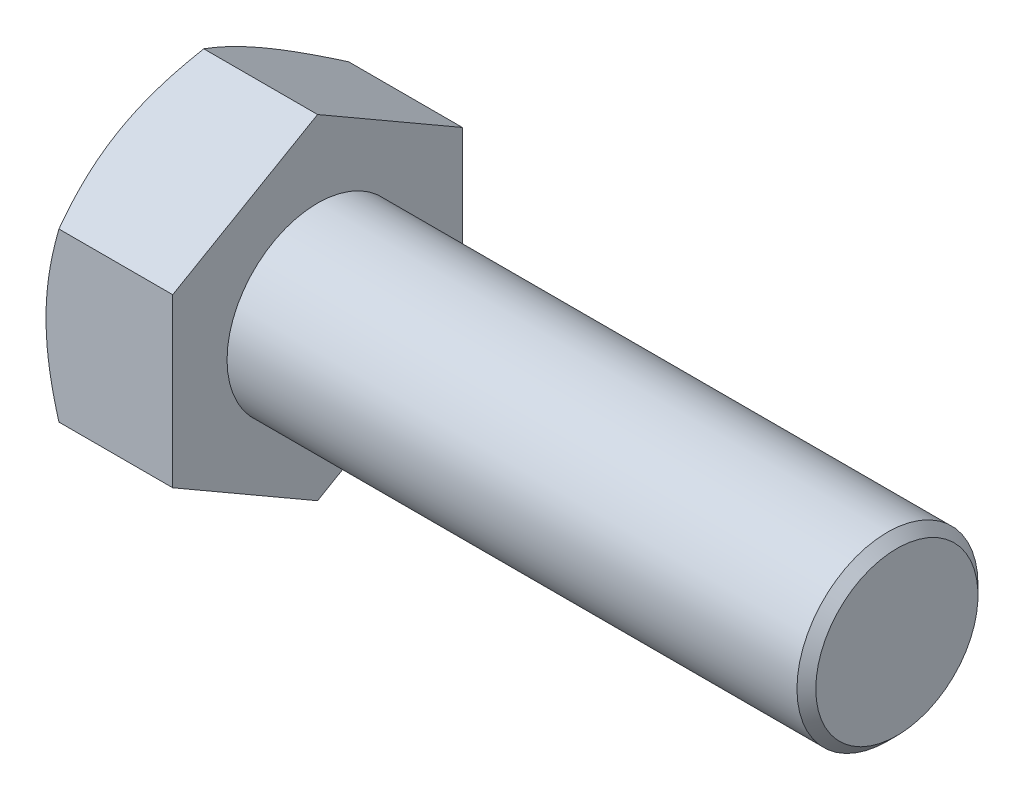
ISO-10303-21;
HEADER;
FILE_DESCRIPTION(('STEP AP214'),'2;1');
FILE_NAME('part.step','',(''),(''),'','','');
FILE_SCHEMA(('AUTOMOTIVE_DESIGN { 1 0 10303 214 1 1 1 1 }'));
ENDSEC;
DATA;
#1=APPLICATION_CONTEXT('core data for automotive mechanical design processes');
#2=APPLICATION_PROTOCOL_DEFINITION('international standard','automotive_design',2000,#1);
#3=PRODUCT_CONTEXT('',#1,'mechanical');
#4=PRODUCT('Part','Part','',(#3));
#5=PRODUCT_RELATED_PRODUCT_CATEGORY('part','',(#4));
#6=PRODUCT_DEFINITION_FORMATION('','',#4);
#7=PRODUCT_DEFINITION_CONTEXT('part definition',#1,'design');
#8=PRODUCT_DEFINITION('design','',#6,#7);
#9=PRODUCT_DEFINITION_SHAPE('','',#8);
#10=(LENGTH_UNIT() NAMED_UNIT(*) SI_UNIT(.MILLI.,.METRE.));
#11=(NAMED_UNIT(*) PLANE_ANGLE_UNIT() SI_UNIT($,.RADIAN.));
#12=(NAMED_UNIT(*) SI_UNIT($,.STERADIAN.) SOLID_ANGLE_UNIT());
#13=UNCERTAINTY_MEASURE_WITH_UNIT(LENGTH_MEASURE(1.E-05),#10,'distance_accuracy_value','');
#14=(GEOMETRIC_REPRESENTATION_CONTEXT(3) GLOBAL_UNCERTAINTY_ASSIGNED_CONTEXT((#13)) GLOBAL_UNIT_ASSIGNED_CONTEXT((#10,
#11,#12)) REPRESENTATION_CONTEXT('',''));
#15=CARTESIAN_POINT('',(0.,0.,0.));
#16=DIRECTION('',(0.,0.,1.));
#17=DIRECTION('',(1.,0.,0.));
#18=AXIS2_PLACEMENT_3D('',#15,#16,#17);
#19=CARTESIAN_POINT('',(0.,4.61880215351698,0.));
#20=DIRECTION('',(1.,0.,0.));
#21=DIRECTION('',(0.,0.,-1.));
#22=AXIS2_PLACEMENT_3D('',#19,#20,#21);
#23=PLANE('',#22);
#24=CARTESIAN_POINT('',(0.,0.,0.));
#25=DIRECTION('',(1.,0.,0.));
#26=DIRECTION('',(0.,0.,-1.));
#27=AXIS2_PLACEMENT_3D('',#24,#25,#26);
#28=CIRCLE('',#27,4.0000000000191);
#29=CARTESIAN_POINT('',(-5.52335954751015E-12,-3.46410161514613,-2.00000000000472));
#30=VERTEX_POINT('',#29);
#31=CARTESIAN_POINT('',(-5.52335954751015E-12,0.,-4.0000000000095));
#32=VERTEX_POINT('',#31);
#33=EDGE_CURVE('E347',#30,#32,#28,.T.);
#34=ORIENTED_EDGE('',*,*,#33,.F.);
#35=CARTESIAN_POINT('',(0.,0.,0.));
#36=DIRECTION('',(1.,0.,0.));
#37=DIRECTION('',(0.,0.,-1.));
#38=AXIS2_PLACEMENT_3D('',#35,#36,#37);
#39=CIRCLE('',#38,4.0000000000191);
#40=CARTESIAN_POINT('',(-5.49560397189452E-12,-3.46410161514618,2.00000000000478));
#41=VERTEX_POINT('',#40);
#42=EDGE_CURVE('E346',#41,#30,#39,.T.);
#43=ORIENTED_EDGE('',*,*,#42,.F.);
#44=CARTESIAN_POINT('',(0.,0.,0.));
#45=DIRECTION('',(1.,0.,0.));
#46=DIRECTION('',(0.,0.,-1.));
#47=AXIS2_PLACEMENT_3D('',#44,#45,#46);
#48=CIRCLE('',#47,4.0000000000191);
#49=CARTESIAN_POINT('',(-5.49560397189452E-12,0.,4.00000000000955));
#50=VERTEX_POINT('',#49);
#51=EDGE_CURVE('E96',#50,#41,#48,.T.);
#52=ORIENTED_EDGE('',*,*,#51,.F.);
#53=CARTESIAN_POINT('',(0.,0.,0.));
#54=DIRECTION('',(1.,0.,0.));
#55=DIRECTION('',(0.,0.,-1.));
#56=AXIS2_PLACEMENT_3D('',#53,#54,#55);
#57=CIRCLE('',#56,4.0000000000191);
#58=CARTESIAN_POINT('',(-5.49560397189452E-12,3.4641016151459,2.00000000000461));
#59=VERTEX_POINT('',#58);
#60=EDGE_CURVE('E94',#59,#50,#57,.T.);
#61=ORIENTED_EDGE('',*,*,#60,.F.);
#62=CARTESIAN_POINT('',(0.,0.,0.));
#63=DIRECTION('',(1.,0.,0.));
#64=DIRECTION('',(0.,0.,-1.));
#65=AXIS2_PLACEMENT_3D('',#62,#63,#64);
#66=CIRCLE('',#65,4.0000000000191);
#67=CARTESIAN_POINT('',(-5.49560397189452E-12,3.46410161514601,-2.00000000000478));
#68=VERTEX_POINT('',#67);
#69=EDGE_CURVE('E27',#68,#59,#66,.T.);
#70=ORIENTED_EDGE('',*,*,#69,.F.);
#71=CARTESIAN_POINT('',(0.,0.,0.));
#72=DIRECTION('',(1.,0.,0.));
#73=DIRECTION('',(0.,0.,-1.));
#74=AXIS2_PLACEMENT_3D('',#71,#72,#73);
#75=CIRCLE('',#74,4.0000000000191);
#76=EDGE_CURVE('E272',#32,#68,#75,.T.);
#77=ORIENTED_EDGE('',*,*,#76,.F.);
#78=EDGE_LOOP('',(#34,#43,#52,#61,#70,#77));
#79=FACE_BOUND('',#78,.T.);
#80=ADVANCED_FACE('F24',(#79),#23,.F.);
#81=CARTESIAN_POINT('',(0.359409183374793,0.,0.));
#82=DIRECTION('',(1.,0.,0.));
#83=DIRECTION('',(0.,0.,-1.));
#84=AXIS2_PLACEMENT_3D('',#81,#82,#83);
#85=CONICAL_SURFACE('',#84,4.62251496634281,1.04719755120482);
#86=CARTESIAN_POINT('',(0.357265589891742,4.61880215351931,4.10782519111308E-12));
#87=CARTESIAN_POINT('',(0.302985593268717,4.52481002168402,-0.162799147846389));
#88=CARTESIAN_POINT('',(0.253255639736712,4.43006516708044,-0.326902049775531));
#89=CARTESIAN_POINT('',(0.165557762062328,4.23974029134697,-0.656554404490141));
#90=CARTESIAN_POINT('',(0.127531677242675,4.14416690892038,-0.822092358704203));
#91=CARTESIAN_POINT('',(0.0808421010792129,3.99990485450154,-1.0719615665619));
#92=CARTESIAN_POINT('',(0.0669981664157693,3.95163526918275,-1.15556694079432));
#93=CARTESIAN_POINT('',(0.0430340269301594,3.85486501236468,-1.3231779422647));
#94=CARTESIAN_POINT('',(0.032913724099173,3.80636434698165,-1.40718355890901));
#95=CARTESIAN_POINT('',(0.0165746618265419,3.70895253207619,-1.57590577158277));
#96=CARTESIAN_POINT('',(0.0103757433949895,3.66004054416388,-1.66062381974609));
#97=CARTESIAN_POINT('',(0.00207983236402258,3.5621203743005,-1.83022652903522));
#98=CARTESIAN_POINT('',(-1.63478619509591E-05,3.51311217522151,-1.91511121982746));
#99=CARTESIAN_POINT('',(-1.10189635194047E-11,3.46410161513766,-2.00000000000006));
#100=B_SPLINE_CURVE_WITH_KNOTS('',3,(#86,#87,#88,#89,#90,#91,#92,#93,#94,#95,#96,#97,#98,#99),
.UNSPECIFIED.,.F.,.F.,(4,2,2,2,2,2,4),(0.,0.587229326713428,1.17149154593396,1.46400599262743,
1.75651273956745,2.05048788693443,2.34452123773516),.UNSPECIFIED.);
#101=CARTESIAN_POINT('',(0.357265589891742,4.61880215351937,0.));
#102=VERTEX_POINT('',#101);
#103=EDGE_CURVE('E106',#102,#68,#100,.T.);
#104=ORIENTED_EDGE('',*,*,#103,.T.);
#105=ORIENTED_EDGE('',*,*,#69,.T.);
#106=CARTESIAN_POINT('',(-1.10189635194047E-11,3.46410161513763,1.99999999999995));
#107=CARTESIAN_POINT('',(-1.63478619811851E-05,3.51311217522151,1.91511121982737));
#108=CARTESIAN_POINT('',(0.00207983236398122,3.56212037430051,1.83022652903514));
#109=CARTESIAN_POINT('',(0.0103757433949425,3.66004054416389,1.66062381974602));
#110=CARTESIAN_POINT('',(0.0165746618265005,3.70895253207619,1.5759057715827));
#111=CARTESIAN_POINT('',(0.0329137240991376,3.80636434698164,1.40718355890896));
#112=CARTESIAN_POINT('',(0.0430340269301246,3.85486501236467,1.32317794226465));
#113=CARTESIAN_POINT('',(0.0669981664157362,3.95163526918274,1.15556694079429));
#114=CARTESIAN_POINT('',(0.0808421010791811,3.99990485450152,1.07196156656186));
#115=CARTESIAN_POINT('',(0.127531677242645,4.14416690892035,0.822092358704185));
#116=CARTESIAN_POINT('',(0.165557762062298,4.23974029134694,0.656554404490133));
#117=CARTESIAN_POINT('',(0.253255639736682,4.4300651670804,0.326902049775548));
#118=CARTESIAN_POINT('',(0.302985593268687,4.52481002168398,0.162799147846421));
#119=CARTESIAN_POINT('',(0.357265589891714,4.61880215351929,-4.05231403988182E-12));
#120=B_SPLINE_CURVE_WITH_KNOTS('',3,(#106,#107,#108,#109,#110,#111,#112,#113,#114,#115,#116,
#117,#118,#119),.UNSPECIFIED.,.F.,.F.,(4,2,2,2,2,2,4),(0.,0.294033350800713,0.588008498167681,
0.880515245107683,1.17302969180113,1.75729191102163,2.34452123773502),.UNSPECIFIED.);
#121=EDGE_CURVE('E104',#59,#102,#120,.T.);
#122=ORIENTED_EDGE('',*,*,#121,.T.);
#123=EDGE_LOOP('',(#104,#105,#122));
#124=FACE_BOUND('',#123,.T.);
#125=ADVANCED_FACE('F102',(#124),#85,.T.);
#126=CARTESIAN_POINT('',(0.359409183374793,0.,0.));
#127=DIRECTION('',(1.,0.,0.));
#128=DIRECTION('',(0.,0.,-1.));
#129=AXIS2_PLACEMENT_3D('',#126,#127,#128);
#130=CONICAL_SURFACE('',#129,4.62251496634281,1.04719755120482);
#131=CARTESIAN_POINT('',(0.357265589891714,2.30940107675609,4.00000000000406));
#132=CARTESIAN_POINT('',(0.302985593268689,2.40339320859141,3.83720085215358));
#133=CARTESIAN_POINT('',(0.253255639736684,2.49813806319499,3.67309795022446));
#134=CARTESIAN_POINT('',(0.165557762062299,2.68846293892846,3.34344559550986));
#135=CARTESIAN_POINT('',(0.127531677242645,2.78403632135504,3.17790764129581));
#136=CARTESIAN_POINT('',(0.0808421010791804,2.92829837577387,2.92803843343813));
#137=CARTESIAN_POINT('',(0.0669981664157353,2.97656796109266,2.8444330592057));
#138=CARTESIAN_POINT('',(0.0430340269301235,3.07333821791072,2.67682205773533));
#139=CARTESIAN_POINT('',(0.0329137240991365,3.12183888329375,2.59281644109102));
#140=CARTESIAN_POINT('',(0.0165746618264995,3.21925069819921,2.42409422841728));
#141=CARTESIAN_POINT('',(0.0103757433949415,3.26816268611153,2.33937618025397));
#142=CARTESIAN_POINT('',(0.00207983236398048,3.36608285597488,2.16977347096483));
#143=CARTESIAN_POINT('',(-1.6347861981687E-05,3.41509105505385,2.08488878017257));
#144=CARTESIAN_POINT('',(-1.10189635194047E-11,3.46410161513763,1.99999999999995));
#145=B_SPLINE_CURVE_WITH_KNOTS('',3,(#131,#132,#133,#134,#135,#136,#137,#138,#139,#140,#141,
#142,#143,#144),.UNSPECIFIED.,.F.,.F.,(4,2,2,2,2,2,4),(0.,0.587229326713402,1.17149154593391,
1.46400599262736,1.75651273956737,2.05048788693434,2.34452123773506),.UNSPECIFIED.);
#146=CARTESIAN_POINT('',(0.357265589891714,2.30940107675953,4.000000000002));
#147=VERTEX_POINT('',#146);
#148=EDGE_CURVE('E109',#147,#59,#145,.T.);
#149=ORIENTED_EDGE('',*,*,#148,.T.);
#150=ORIENTED_EDGE('',*,*,#60,.T.);
#151=CARTESIAN_POINT('',(-1.10189635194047E-11,0.,3.99999999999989));
#152=CARTESIAN_POINT('',(-1.63478619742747E-05,0.0980211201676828,3.99999999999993));
#153=CARTESIAN_POINT('',(0.00207983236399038,0.196037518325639,3.99999999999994));
#154=CARTESIAN_POINT('',(0.010375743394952,0.391877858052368,3.99999999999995));
#155=CARTESIAN_POINT('',(0.016574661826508,0.489701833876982,3.99999999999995));
#156=CARTESIAN_POINT('',(0.0329137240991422,0.684525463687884,3.99999999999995));
#157=CARTESIAN_POINT('',(0.0430340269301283,0.781526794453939,3.99999999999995));
#158=CARTESIAN_POINT('',(0.0669981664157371,0.975067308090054,3.99999999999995));
#159=CARTESIAN_POINT('',(0.0808421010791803,1.07160647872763,3.99999999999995));
#160=CARTESIAN_POINT('',(0.127531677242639,1.36013058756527,3.99999999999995));
#161=CARTESIAN_POINT('',(0.165557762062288,1.55127735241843,3.99999999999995));
#162=CARTESIAN_POINT('',(0.253255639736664,1.93192710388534,3.99999999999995));
#163=CARTESIAN_POINT('',(0.302985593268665,2.1214168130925,3.99999999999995));
#164=CARTESIAN_POINT('',(0.357265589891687,2.30940107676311,3.99999999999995));
#165=B_SPLINE_CURVE_WITH_KNOTS('',3,(#151,#152,#153,#154,#155,#156,#157,#158,#159,#160,#161,
#162,#163,#164),.UNSPECIFIED.,.F.,.F.,(4,2,2,2,2,2,4),(0.,0.294033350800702,0.588008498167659,
0.880515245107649,1.17302969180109,1.75729191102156,2.34452123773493),.UNSPECIFIED.);
#166=EDGE_CURVE('E112',#50,#147,#165,.T.);
#167=ORIENTED_EDGE('',*,*,#166,.T.);
#168=EDGE_LOOP('',(#149,#150,#167));
#169=FACE_BOUND('',#168,.T.);
#170=ADVANCED_FACE('F110',(#169),#130,.T.);
#171=CARTESIAN_POINT('',(0.359409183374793,0.,0.));
#172=DIRECTION('',(1.,0.,0.));
#173=DIRECTION('',(0.,0.,-1.));
#174=AXIS2_PLACEMENT_3D('',#171,#172,#173);
#175=CONICAL_SURFACE('',#174,4.62251496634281,1.04719755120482);
#176=ORIENTED_EDGE('',*,*,#51,.T.);
#177=CARTESIAN_POINT('',(-1.10189635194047E-11,-3.46410161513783,1.99999999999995));
#178=CARTESIAN_POINT('',(-1.63478618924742E-05,-3.41509105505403,2.08488878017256));
#179=CARTESIAN_POINT('',(0.00207983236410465,-3.36608285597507,2.16977347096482));
#180=CARTESIAN_POINT('',(0.0103757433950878,-3.26816268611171,2.33937618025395));
#181=CARTESIAN_POINT('',(0.016574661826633,-3.2192506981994,2.42409422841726));
#182=CARTESIAN_POINT('',(0.0329137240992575,-3.12183888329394,2.59281644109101));
#183=CARTESIAN_POINT('',(0.0430340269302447,-3.07333821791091,2.67682205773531));
#184=CARTESIAN_POINT('',(0.0669981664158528,-2.97656796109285,2.84443305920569));
#185=CARTESIAN_POINT('',(0.080842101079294,-2.92829837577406,2.92803843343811));
#186=CARTESIAN_POINT('',(0.127531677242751,-2.78403632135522,3.17790764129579));
#187=CARTESIAN_POINT('',(0.165557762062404,-2.68846293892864,3.34344559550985));
#188=CARTESIAN_POINT('',(0.253255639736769,-2.49813806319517,3.67309795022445));
#189=CARTESIAN_POINT('',(0.302985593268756,-2.40339320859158,3.83720085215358));
#190=CARTESIAN_POINT('',(0.357265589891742,-2.30940107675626,4.00000000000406));
#191=B_SPLINE_CURVE_WITH_KNOTS('',3,(#177,#178,#179,#180,#181,#182,#183,#184,#185,#186,#187,
#188,#189,#190),.UNSPECIFIED.,.F.,.F.,(4,2,2,2,2,2,4),(0.,0.294033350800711,0.588008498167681,
0.880515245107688,1.17302969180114,1.75729191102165,2.34452123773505),.UNSPECIFIED.);
#192=CARTESIAN_POINT('',(0.357265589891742,-2.30940107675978,4.00000000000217));
#193=VERTEX_POINT('',#192);
#194=EDGE_CURVE('E187',#41,#193,#191,.T.);
#195=ORIENTED_EDGE('',*,*,#194,.T.);
#196=CARTESIAN_POINT('',(0.357265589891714,-2.30940107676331,4.));
#197=CARTESIAN_POINT('',(0.302985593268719,-2.12141681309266,3.99999999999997));
#198=CARTESIAN_POINT('',(0.253255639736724,-1.93192710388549,3.99999999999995));
#199=CARTESIAN_POINT('',(0.165557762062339,-1.55127735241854,3.99999999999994));
#200=CARTESIAN_POINT('',(0.127531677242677,-1.36013058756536,3.99999999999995));
#201=CARTESIAN_POINT('',(0.0808421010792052,-1.07160647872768,3.99999999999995));
#202=CARTESIAN_POINT('',(0.0669981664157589,-0.975067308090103,3.99999999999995));
#203=CARTESIAN_POINT('',(0.0430340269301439,-0.781526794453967,3.99999999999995));
#204=CARTESIAN_POINT('',(0.032913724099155,-0.684525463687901,3.99999999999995));
#205=CARTESIAN_POINT('',(0.0165746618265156,-0.489701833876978,3.99999999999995));
#206=CARTESIAN_POINT('',(0.0103757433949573,-0.391877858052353,3.99999999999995));
#207=CARTESIAN_POINT('',(0.00207983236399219,-0.196037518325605,3.99999999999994));
#208=CARTESIAN_POINT('',(-1.63478619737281E-05,-0.0980211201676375,3.99999999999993));
#209=CARTESIAN_POINT('',(-1.10189635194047E-11,0.,3.99999999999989));
#210=B_SPLINE_CURVE_WITH_KNOTS('',3,(#196,#197,#198,#199,#200,#201,#202,#203,#204,#205,#206,
#207,#208,#209),.UNSPECIFIED.,.F.,.F.,(4,2,2,2,2,2,4),(0.,0.58722932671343,1.17149154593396,
1.46400599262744,1.75651273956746,2.05048788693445,2.34452123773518),.UNSPECIFIED.);
#211=EDGE_CURVE('E159',#193,#50,#210,.T.);
#212=ORIENTED_EDGE('',*,*,#211,.T.);
#213=EDGE_LOOP('',(#176,#195,#212));
#214=FACE_BOUND('',#213,.T.);
#215=ADVANCED_FACE('F149',(#214),#175,.T.);
#216=CARTESIAN_POINT('',(0.359409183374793,0.,0.));
#217=DIRECTION('',(1.,0.,0.));
#218=DIRECTION('',(0.,0.,-1.));
#219=AXIS2_PLACEMENT_3D('',#216,#217,#218);
#220=CONICAL_SURFACE('',#219,4.62251496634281,1.04719755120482);
#221=ORIENTED_EDGE('',*,*,#42,.T.);
#222=CARTESIAN_POINT('',(-1.10189635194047E-11,-3.46410161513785,-2.));
#223=CARTESIAN_POINT('',(-1.63478618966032E-05,-3.51311217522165,-1.91511121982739));
#224=CARTESIAN_POINT('',(0.00207983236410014,-3.56212037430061,-1.83022652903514));
#225=CARTESIAN_POINT('',(0.0103757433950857,-3.66004054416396,-1.66062381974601));
#226=CARTESIAN_POINT('',(0.0165746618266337,-3.70895253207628,-1.5759057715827));
#227=CARTESIAN_POINT('',(0.0329137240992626,-3.80636434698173,-1.40718355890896));
#228=CARTESIAN_POINT('',(0.0430340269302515,-3.85486501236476,-1.32317794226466));
#229=CARTESIAN_POINT('',(0.0669981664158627,-3.95163526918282,-1.15556694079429));
#230=CARTESIAN_POINT('',(0.0808421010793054,-3.99990485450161,-1.07196156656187));
#231=CARTESIAN_POINT('',(0.127531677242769,-4.14416690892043,-0.822092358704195));
#232=CARTESIAN_POINT('',(0.165557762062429,-4.23974029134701,-0.656554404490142));
#233=CARTESIAN_POINT('',(0.253255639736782,-4.43006516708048,-0.326902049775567));
#234=CARTESIAN_POINT('',(0.30298559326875,-4.52481002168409,-0.162799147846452));
#235=CARTESIAN_POINT('',(0.357265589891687,-4.61880215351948,3.99680288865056E-12));
#236=B_SPLINE_CURVE_WITH_KNOTS('',3,(#222,#223,#224,#225,#226,#227,#228,#229,#230,#231,#232,
#233,#234,#235),.UNSPECIFIED.,.F.,.F.,(4,2,2,2,2,2,4),(0.,0.294033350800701,0.588008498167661,
0.880515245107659,1.17302969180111,1.75729191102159,2.34452123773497),.UNSPECIFIED.);
#237=CARTESIAN_POINT('',(0.357265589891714,-4.61880215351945,0.));
#238=VERTEX_POINT('',#237);
#239=EDGE_CURVE('E319',#30,#238,#236,.T.);
#240=ORIENTED_EDGE('',*,*,#239,.T.);
#241=CARTESIAN_POINT('',(0.357265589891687,-4.61880215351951,-4.16333634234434E-12));
#242=CARTESIAN_POINT('',(0.302985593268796,-4.52481002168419,0.162799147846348));
#243=CARTESIAN_POINT('',(0.253255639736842,-4.4300651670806,0.326902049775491));
#244=CARTESIAN_POINT('',(0.16555776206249,-4.23974029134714,0.656554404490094));
#245=CARTESIAN_POINT('',(0.127531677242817,-4.14416690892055,0.822092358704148));
#246=CARTESIAN_POINT('',(0.0808421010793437,-3.99990485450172,1.07196156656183));
#247=CARTESIAN_POINT('',(0.0669981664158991,-3.95163526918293,1.15556694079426));
#248=CARTESIAN_POINT('',(0.0430340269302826,-3.85486501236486,1.32317794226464));
#249=CARTESIAN_POINT('',(0.0329137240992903,-3.80636434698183,1.40718355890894));
#250=CARTESIAN_POINT('',(0.0165746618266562,-3.70895253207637,1.57590577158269));
#251=CARTESIAN_POINT('',(0.0103757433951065,-3.66004054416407,1.66062381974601));
#252=CARTESIAN_POINT('',(0.00207983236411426,-3.56212037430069,1.83022652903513));
#253=CARTESIAN_POINT('',(-1.63478618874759E-05,-3.51311217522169,1.91511121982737));
#254=CARTESIAN_POINT('',(-1.10189635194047E-11,-3.46410161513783,1.99999999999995));
#255=B_SPLINE_CURVE_WITH_KNOTS('',3,(#241,#242,#243,#244,#245,#246,#247,#248,#249,#250,#251,
#252,#253,#254),.UNSPECIFIED.,.F.,.F.,(4,2,2,2,2,2,4),(0.,0.587229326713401,1.17149154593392,
1.46400599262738,1.75651273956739,2.05048788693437,2.34452123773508),.UNSPECIFIED.);
#256=EDGE_CURVE('E181',#238,#41,#255,.T.);
#257=ORIENTED_EDGE('',*,*,#256,.T.);
#258=EDGE_LOOP('',(#221,#240,#257));
#259=FACE_BOUND('',#258,.T.);
#260=ADVANCED_FACE('F337',(#259),#220,.T.);
#261=CARTESIAN_POINT('',(0.359409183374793,0.,0.));
#262=DIRECTION('',(1.,0.,0.));
#263=DIRECTION('',(0.,0.,-1.));
#264=AXIS2_PLACEMENT_3D('',#261,#262,#263);
#265=CONICAL_SURFACE('',#264,4.62251496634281,1.04719755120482);
#266=ORIENTED_EDGE('',*,*,#33,.T.);
#267=CARTESIAN_POINT('',(-1.10189635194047E-11,0.,-4.00000000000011));
#268=CARTESIAN_POINT('',(-1.63478619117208E-05,-0.0980211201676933,-4.00000000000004));
#269=CARTESIAN_POINT('',(0.00207983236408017,-0.196037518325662,-4.00000000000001));
#270=CARTESIAN_POINT('',(0.0103757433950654,-0.391877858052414,-3.99999999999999));
#271=CARTESIAN_POINT('',(0.0165746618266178,-0.489701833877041,-4.));
#272=CARTESIAN_POINT('',(0.0329137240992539,-0.68452546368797,-4.00000000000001));
#273=CARTESIAN_POINT('',(0.0430340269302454,-0.781526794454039,-4.));
#274=CARTESIAN_POINT('',(0.0669981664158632,-0.975067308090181,-4.));
#275=CARTESIAN_POINT('',(0.0808421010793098,-1.07160647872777,-4.));
#276=CARTESIAN_POINT('',(0.127531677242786,-1.36013058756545,-4.00000000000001));
#277=CARTESIAN_POINT('',(0.165557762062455,-1.55127735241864,-4.00000000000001));
#278=CARTESIAN_POINT('',(0.253255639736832,-1.9319271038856,-4.));
#279=CARTESIAN_POINT('',(0.302985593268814,-2.12141681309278,-3.99999999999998));
#280=CARTESIAN_POINT('',(0.35726558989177,-2.30940107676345,-3.99999999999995));
#281=B_SPLINE_CURVE_WITH_KNOTS('',3,(#267,#268,#269,#270,#271,#272,#273,#274,#275,#276,#277,
#278,#279,#280),.UNSPECIFIED.,.F.,.F.,(4,2,2,2,2,2,4),(0.,0.294033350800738,0.588008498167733,
0.880515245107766,1.17302969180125,1.7572919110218,2.34452123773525),.UNSPECIFIED.);
#282=CARTESIAN_POINT('',(0.357265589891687,-2.30940107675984,-4.00000000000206));
#283=VERTEX_POINT('',#282);
#284=EDGE_CURVE('E248',#32,#283,#281,.T.);
#285=ORIENTED_EDGE('',*,*,#284,.T.);
#286=CARTESIAN_POINT('',(0.357265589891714,-2.3094010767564,-4.00000000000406));
#287=CARTESIAN_POINT('',(0.302985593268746,-2.40339320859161,-3.83720085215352));
#288=CARTESIAN_POINT('',(0.253255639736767,-2.49813806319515,-3.67309795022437));
#289=CARTESIAN_POINT('',(0.165557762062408,-2.68846293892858,-3.34344559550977));
#290=CARTESIAN_POINT('',(0.127531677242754,-2.78403632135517,-3.17790764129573));
#291=CARTESIAN_POINT('',(0.0808421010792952,-2.928298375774,-2.92803843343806));
#292=CARTESIAN_POINT('',(0.0669981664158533,-2.97656796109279,-2.84443305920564));
#293=CARTESIAN_POINT('',(0.0430340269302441,-3.07333821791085,-2.67682205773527));
#294=CARTESIAN_POINT('',(0.0329137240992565,-3.12183888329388,-2.59281644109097));
#295=CARTESIAN_POINT('',(0.0165746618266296,-3.21925069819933,-2.42409422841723));
#296=CARTESIAN_POINT('',(0.0103757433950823,-3.26816268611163,-2.33937618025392));
#297=CARTESIAN_POINT('',(0.00207983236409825,-3.366082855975,-2.16977347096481));
#298=CARTESIAN_POINT('',(-1.63478618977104E-05,-3.41509105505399,-2.08488878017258));
#299=CARTESIAN_POINT('',(-1.10189635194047E-11,-3.46410161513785,-2.));
#300=B_SPLINE_CURVE_WITH_KNOTS('',3,(#286,#287,#288,#289,#290,#291,#292,#293,#294,#295,#296,
#297,#298,#299),.UNSPECIFIED.,.F.,.F.,(4,2,2,2,2,2,4),(0.,0.587229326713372,1.17149154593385,
1.4640059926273,1.75651273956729,2.05048788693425,2.34452123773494),.UNSPECIFIED.);
#301=EDGE_CURVE('E318',#283,#30,#300,.T.);
#302=ORIENTED_EDGE('',*,*,#301,.T.);
#303=EDGE_LOOP('',(#266,#285,#302));
#304=FACE_BOUND('',#303,.T.);
#305=ADVANCED_FACE('F263',(#304),#265,.T.);
#306=CARTESIAN_POINT('',(0.359409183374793,0.,0.));
#307=DIRECTION('',(1.,0.,0.));
#308=DIRECTION('',(0.,0.,-1.));
#309=AXIS2_PLACEMENT_3D('',#306,#307,#308);
#310=CONICAL_SURFACE('',#309,4.62251496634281,1.04719755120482);
#311=CARTESIAN_POINT('',(0.357265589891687,2.30940107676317,-4.00000000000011));
#312=CARTESIAN_POINT('',(0.302985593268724,2.12141681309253,-4.00000000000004));
#313=CARTESIAN_POINT('',(0.253255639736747,1.93192710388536,-4.00000000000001));
#314=CARTESIAN_POINT('',(0.165557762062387,1.55127735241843,-3.99999999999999));
#315=CARTESIAN_POINT('',(0.12753167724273,1.36013058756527,-4.));
#316=CARTESIAN_POINT('',(0.0808421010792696,1.07160647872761,-4.));
#317=CARTESIAN_POINT('',(0.0669981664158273,0.975067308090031,-4.));
#318=CARTESIAN_POINT('',(0.0430340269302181,0.781526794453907,-4.));
#319=CARTESIAN_POINT('',(0.0329137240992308,0.684525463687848,-4.00000000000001));
#320=CARTESIAN_POINT('',(0.0165746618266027,0.489701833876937,-4.));
#321=CARTESIAN_POINT('',(0.010375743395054,0.39187785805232,-3.99999999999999));
#322=CARTESIAN_POINT('',(0.00207983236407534,0.196037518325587,-4.00000000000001));
#323=CARTESIAN_POINT('',(-1.63478619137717E-05,0.0980211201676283,-4.00000000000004));
#324=CARTESIAN_POINT('',(-1.10189635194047E-11,0.,-4.00000000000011));
#325=B_SPLINE_CURVE_WITH_KNOTS('',3,(#311,#312,#313,#314,#315,#316,#317,#318,#319,#320,#321,
#322,#323,#324),.UNSPECIFIED.,.F.,.F.,(4,2,2,2,2,2,4),(0.,0.58722932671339,1.17149154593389,
1.46400599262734,1.75651273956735,2.05048788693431,2.34452123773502),.UNSPECIFIED.);
#326=CARTESIAN_POINT('',(0.357265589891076,2.30940107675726,-4.00000000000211));
#327=VERTEX_POINT('',#326);
#328=EDGE_CURVE('E239',#327,#32,#325,.T.);
#329=ORIENTED_EDGE('',*,*,#328,.T.);
#330=ORIENTED_EDGE('',*,*,#76,.T.);
#331=CARTESIAN_POINT('',(-1.10189635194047E-11,3.46410161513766,-2.00000000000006));
#332=CARTESIAN_POINT('',(-1.63478619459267E-05,3.41509105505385,-2.08488878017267));
#333=CARTESIAN_POINT('',(0.00207983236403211,3.36608285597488,-2.16977347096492));
#334=CARTESIAN_POINT('',(0.0103757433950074,3.26816268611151,-2.33937618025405));
#335=CARTESIAN_POINT('',(0.0165746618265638,3.2192506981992,-2.42409422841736));
#336=CARTESIAN_POINT('',(0.0329137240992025,3.12183888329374,-2.59281644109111));
#337=CARTESIAN_POINT('',(0.0430340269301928,3.07333821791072,-2.67682205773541));
#338=CARTESIAN_POINT('',(0.0669981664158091,2.97656796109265,-2.84443305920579));
#339=CARTESIAN_POINT('',(0.0808421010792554,2.92829837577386,-2.92803843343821));
#340=CARTESIAN_POINT('',(0.127531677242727,2.78403632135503,-3.17790764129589));
#341=CARTESIAN_POINT('',(0.165557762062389,2.68846293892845,-3.34344559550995));
#342=CARTESIAN_POINT('',(0.253255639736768,2.49813806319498,-3.67309795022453));
#343=CARTESIAN_POINT('',(0.302985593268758,2.40339320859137,-3.83720085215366));
#344=CARTESIAN_POINT('',(0.357265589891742,2.30940107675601,-4.00000000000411));
#345=B_SPLINE_CURVE_WITH_KNOTS('',3,(#331,#332,#333,#334,#335,#336,#337,#338,#339,#340,#341,
#342,#343,#344),.UNSPECIFIED.,.F.,.F.,(4,2,2,2,2,2,4),(0.,0.294033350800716,0.588008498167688,
0.880515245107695,1.17302969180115,1.75729191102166,2.34452123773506),.UNSPECIFIED.);
#346=EDGE_CURVE('E122',#68,#327,#345,.T.);
#347=ORIENTED_EDGE('',*,*,#346,.T.);
#348=EDGE_LOOP('',(#329,#330,#347));
#349=FACE_BOUND('',#348,.T.);
#350=ADVANCED_FACE('F258',(#349),#310,.T.);
#351=CARTESIAN_POINT('',(19.5,0.,0.));
#352=DIRECTION('',(-1.,0.,0.));
#353=DIRECTION('',(0.,0.,1.));
#354=AXIS2_PLACEMENT_3D('',#351,#352,#353);
#355=PLANE('',#354);
#356=CARTESIAN_POINT('',(19.4999999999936,0.,0.));
#357=DIRECTION('',(-1.,0.,0.));
#358=DIRECTION('',(0.,0.,1.));
#359=AXIS2_PLACEMENT_3D('',#356,#357,#358);
#360=CIRCLE('',#359,2.23999999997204);
#361=CARTESIAN_POINT('',(19.4999999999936,0.,2.23999999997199));
#362=VERTEX_POINT('',#361);
#363=EDGE_CURVE('E210',#362,#362,#360,.T.);
#364=ORIENTED_EDGE('',*,*,#363,.F.);
#365=EDGE_LOOP('',(#364));
#366=FACE_BOUND('',#365,.T.);
#367=ADVANCED_FACE('F262',(#366),#355,.F.);
#368=CARTESIAN_POINT('',(3.50000000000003,2.30940107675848,-4.));
#369=DIRECTION('',(0.,-0.866025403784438,0.500000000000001));
#370=DIRECTION('',(0.,-0.500000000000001,-0.866025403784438));
#371=AXIS2_PLACEMENT_3D('',#368,#369,#370);
#372=PLANE('',#371);
#373=DIRECTION('',(1.,0.,0.));
#374=VECTOR('',#373,1.);
#375=CARTESIAN_POINT('',(3.49999999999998,4.61880215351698,0.));
#376=LINE('',#375,#374);
#377=CARTESIAN_POINT('',(3.49999999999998,4.61880215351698,0.));
#378=VERTEX_POINT('',#377);
#379=EDGE_CURVE('E115',#102,#378,#376,.T.);
#380=ORIENTED_EDGE('',*,*,#379,.T.);
#381=DIRECTION('',(0.,0.500000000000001,0.866025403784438));
#382=VECTOR('',#381,1.);
#383=CARTESIAN_POINT('',(3.50000000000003,2.30940107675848,-4.));
#384=LINE('',#383,#382);
#385=CARTESIAN_POINT('',(3.50000000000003,2.30940107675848,-4.));
#386=VERTEX_POINT('',#385);
#387=EDGE_CURVE('E206',#386,#378,#384,.T.);
#388=ORIENTED_EDGE('',*,*,#387,.F.);
#389=DIRECTION('',(1.,0.,0.));
#390=VECTOR('',#389,1.);
#391=CARTESIAN_POINT('',(3.50000000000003,2.30940107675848,-4.));
#392=LINE('',#391,#390);
#393=EDGE_CURVE('E247',#386,#327,#392,.F.);
#394=ORIENTED_EDGE('',*,*,#393,.T.);
#395=ORIENTED_EDGE('',*,*,#346,.F.);
#396=ORIENTED_EDGE('',*,*,#103,.F.);
#397=EDGE_LOOP('',(#380,#388,#394,#395,#396));
#398=FACE_BOUND('',#397,.T.);
#399=ADVANCED_FACE('F274',(#398),#372,.F.);
#400=CARTESIAN_POINT('',(3.49999999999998,4.61880215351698,0.));
#401=DIRECTION('',(0.,-0.866025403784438,-0.500000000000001));
#402=DIRECTION('',(0.,0.500000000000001,-0.866025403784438));
#403=AXIS2_PLACEMENT_3D('',#400,#401,#402);
#404=PLANE('',#403);
#405=DIRECTION('',(1.,0.,0.));
#406=VECTOR('',#405,1.);
#407=CARTESIAN_POINT('',(3.49999999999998,2.30940107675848,3.99999999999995));
#408=LINE('',#407,#406);
#409=CARTESIAN_POINT('',(3.49999999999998,2.30940107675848,3.99999999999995));
#410=VERTEX_POINT('',#409);
#411=EDGE_CURVE('E158',#147,#410,#408,.T.);
#412=ORIENTED_EDGE('',*,*,#411,.T.);
#413=DIRECTION('',(0.,-0.500000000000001,0.866025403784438));
#414=VECTOR('',#413,1.);
#415=CARTESIAN_POINT('',(3.49999999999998,4.61880215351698,0.));
#416=LINE('',#415,#414);
#417=EDGE_CURVE('E209',#378,#410,#416,.T.);
#418=ORIENTED_EDGE('',*,*,#417,.F.);
#419=ORIENTED_EDGE('',*,*,#379,.F.);
#420=ORIENTED_EDGE('',*,*,#121,.F.);
#421=ORIENTED_EDGE('',*,*,#148,.F.);
#422=EDGE_LOOP('',(#412,#418,#419,#420,#421));
#423=FACE_BOUND('',#422,.T.);
#424=ADVANCED_FACE('F118',(#423),#404,.F.);
#425=CARTESIAN_POINT('',(3.49999999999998,2.30940107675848,3.99999999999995));
#426=DIRECTION('',(0.,0.,-1.));
#427=DIRECTION('',(0.,1.,0.));
#428=AXIS2_PLACEMENT_3D('',#425,#426,#427);
#429=PLANE('',#428);
#430=DIRECTION('',(1.,0.,0.));
#431=VECTOR('',#430,1.);
#432=CARTESIAN_POINT('',(3.5,-2.30940107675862,4.));
#433=LINE('',#432,#431);
#434=CARTESIAN_POINT('',(3.5,-2.30940107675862,4.));
#435=VERTEX_POINT('',#434);
#436=EDGE_CURVE('E192',#193,#435,#433,.T.);
#437=ORIENTED_EDGE('',*,*,#436,.T.);
#438=DIRECTION('',(0.,1.,0.));
#439=VECTOR('',#438,1.);
#440=CARTESIAN_POINT('',(3.5,4.61880215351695,4.00000000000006));
#441=LINE('',#440,#439);
#442=EDGE_CURVE('E226',#410,#435,#441,.F.);
#443=ORIENTED_EDGE('',*,*,#442,.F.);
#444=ORIENTED_EDGE('',*,*,#411,.F.);
#445=ORIENTED_EDGE('',*,*,#166,.F.);
#446=ORIENTED_EDGE('',*,*,#211,.F.);
#447=EDGE_LOOP('',(#437,#443,#444,#445,#446));
#448=FACE_BOUND('',#447,.T.);
#449=ADVANCED_FACE('F165',(#448),#429,.F.);
#450=CARTESIAN_POINT('',(3.5,-4.61880215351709,0.));
#451=DIRECTION('',(0.,0.866025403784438,-0.500000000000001));
#452=DIRECTION('',(0.,0.500000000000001,0.866025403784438));
#453=AXIS2_PLACEMENT_3D('',#450,#451,#452);
#454=PLANE('',#453);
#455=DIRECTION('',(1.,0.,0.));
#456=VECTOR('',#455,1.);
#457=CARTESIAN_POINT('',(3.5,-4.61880215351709,0.));
#458=LINE('',#457,#456);
#459=CARTESIAN_POINT('',(3.5,-4.61880215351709,0.));
#460=VERTEX_POINT('',#459);
#461=EDGE_CURVE('E316',#238,#460,#458,.T.);
#462=ORIENTED_EDGE('',*,*,#461,.T.);
#463=DIRECTION('',(0.,-0.500000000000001,-0.866025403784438));
#464=VECTOR('',#463,1.);
#465=CARTESIAN_POINT('',(3.5,-2.30940107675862,4.));
#466=LINE('',#465,#464);
#467=EDGE_CURVE('E221',#435,#460,#466,.T.);
#468=ORIENTED_EDGE('',*,*,#467,.F.);
#469=ORIENTED_EDGE('',*,*,#436,.F.);
#470=ORIENTED_EDGE('',*,*,#194,.F.);
#471=ORIENTED_EDGE('',*,*,#256,.F.);
#472=EDGE_LOOP('',(#462,#468,#469,#470,#471));
#473=FACE_BOUND('',#472,.T.);
#474=ADVANCED_FACE('F169',(#473),#454,.F.);
#475=CARTESIAN_POINT('',(3.5,-2.30940107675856,-3.99999999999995));
#476=DIRECTION('',(0.,0.866025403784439,0.5));
#477=DIRECTION('',(0.,-0.5,0.866025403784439));
#478=AXIS2_PLACEMENT_3D('',#475,#476,#477);
#479=PLANE('',#478);
#480=DIRECTION('',(1.,0.,0.));
#481=VECTOR('',#480,1.);
#482=CARTESIAN_POINT('',(3.5,-2.30940107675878,-4.00000000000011));
#483=LINE('',#482,#481);
#484=CARTESIAN_POINT('',(3.49999999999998,-2.30940107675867,-4.00000000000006));
#485=VERTEX_POINT('',#484);
#486=EDGE_CURVE('E42',#283,#485,#483,.T.);
#487=ORIENTED_EDGE('',*,*,#486,.T.);
#488=DIRECTION('',(0.,0.5,-0.866025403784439));
#489=VECTOR('',#488,1.);
#490=CARTESIAN_POINT('',(3.5,-4.61880215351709,0.));
#491=LINE('',#490,#489);
#492=EDGE_CURVE('E216',#460,#485,#491,.T.);
#493=ORIENTED_EDGE('',*,*,#492,.F.);
#494=ORIENTED_EDGE('',*,*,#461,.F.);
#495=ORIENTED_EDGE('',*,*,#239,.F.);
#496=ORIENTED_EDGE('',*,*,#301,.F.);
#497=EDGE_LOOP('',(#487,#493,#494,#495,#496));
#498=FACE_BOUND('',#497,.T.);
#499=ADVANCED_FACE('F175',(#498),#479,.F.);
#500=CARTESIAN_POINT('',(3.50000000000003,2.30940107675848,-4.));
#501=DIRECTION('',(0.,0.,1.));
#502=DIRECTION('',(0.,-1.,0.));
#503=AXIS2_PLACEMENT_3D('',#500,#501,#502);
#504=PLANE('',#503);
#505=ORIENTED_EDGE('',*,*,#393,.F.);
#506=DIRECTION('',(0.,1.,0.));
#507=VECTOR('',#506,1.);
#508=CARTESIAN_POINT('',(3.5,4.61880215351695,-3.99999999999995));
#509=LINE('',#508,#507);
#510=EDGE_CURVE('E213',#485,#386,#509,.T.);
#511=ORIENTED_EDGE('',*,*,#510,.F.);
#512=ORIENTED_EDGE('',*,*,#486,.F.);
#513=ORIENTED_EDGE('',*,*,#284,.F.);
#514=ORIENTED_EDGE('',*,*,#328,.F.);
#515=EDGE_LOOP('',(#505,#511,#512,#513,#514));
#516=FACE_BOUND('',#515,.T.);
#517=ADVANCED_FACE('F255',(#516),#504,.F.);
#518=CARTESIAN_POINT('',(19.2399999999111,-1.11022302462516E-13,0.));
#519=DIRECTION('',(-1.,0.,0.));
#520=DIRECTION('',(0.,0.,1.));
#521=AXIS2_PLACEMENT_3D('',#518,#519,#520);
#522=CONICAL_SURFACE('',#521,2.50000000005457,0.785398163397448);
#523=CARTESIAN_POINT('',(19.24,0.,0.));
#524=DIRECTION('',(-1.,0.,0.));
#525=DIRECTION('',(0.,0.,1.));
#526=AXIS2_PLACEMENT_3D('',#523,#524,#525);
#527=CIRCLE('',#526,2.5);
#528=CARTESIAN_POINT('',(19.24,0.,2.5));
#529=VERTEX_POINT('',#528);
#530=EDGE_CURVE('E33',#529,#529,#527,.T.);
#531=ORIENTED_EDGE('',*,*,#530,.F.);
#532=EDGE_LOOP('',(#531));
#533=FACE_BOUND('',#532,.T.);
#534=ORIENTED_EDGE('',*,*,#363,.T.);
#535=EDGE_LOOP('',(#534));
#536=FACE_BOUND('',#535,.T.);
#537=ADVANCED_FACE('F293',(#533,#536),#522,.T.);
#538=CARTESIAN_POINT('',(3.49999999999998,4.61880215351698,0.));
#539=DIRECTION('',(1.,0.,0.));
#540=DIRECTION('',(0.,0.,-1.));
#541=AXIS2_PLACEMENT_3D('',#538,#539,#540);
#542=PLANE('',#541);
#543=ORIENTED_EDGE('',*,*,#492,.T.);
#544=ORIENTED_EDGE('',*,*,#510,.T.);
#545=ORIENTED_EDGE('',*,*,#387,.T.);
#546=ORIENTED_EDGE('',*,*,#417,.T.);
#547=ORIENTED_EDGE('',*,*,#442,.T.);
#548=ORIENTED_EDGE('',*,*,#467,.T.);
#549=EDGE_LOOP('',(#543,#544,#545,#546,#547,#548));
#550=FACE_BOUND('',#549,.T.);
#551=CARTESIAN_POINT('',(3.49999999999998,-1.11022302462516E-13,0.));
#552=DIRECTION('',(-1.,0.,0.));
#553=DIRECTION('',(0.,0.,1.));
#554=AXIS2_PLACEMENT_3D('',#551,#552,#553);
#555=CIRCLE('',#554,2.5);
#556=CARTESIAN_POINT('',(3.49999999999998,-1.10866177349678E-13,2.49999999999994));
#557=VERTEX_POINT('',#556);
#558=EDGE_CURVE('E13',#557,#557,#555,.F.);
#559=ORIENTED_EDGE('',*,*,#558,.F.);
#560=EDGE_LOOP('',(#559));
#561=FACE_BOUND('',#560,.T.);
#562=ADVANCED_FACE('F287',(#550,#561),#542,.T.);
#563=CARTESIAN_POINT('',(0.,0.,0.));
#564=DIRECTION('',(-1.,0.,0.));
#565=DIRECTION('',(0.,0.,1.));
#566=AXIS2_PLACEMENT_3D('',#563,#564,#565);
#567=CYLINDRICAL_SURFACE('',#566,2.5);
#568=ORIENTED_EDGE('',*,*,#558,.T.);
#569=EDGE_LOOP('',(#568));
#570=FACE_BOUND('',#569,.T.);
#571=ORIENTED_EDGE('',*,*,#530,.T.);
#572=EDGE_LOOP('',(#571));
#573=FACE_BOUND('',#572,.T.);
#574=ADVANCED_FACE('F285',(#570,#573),#567,.T.);
#575=CLOSED_SHELL('',(#80,#125,#170,#215,#260,#305,#350,#367,#399,#424,#449,#474,#499,#517,#537,
#562,#574));
#576=MANIFOLD_SOLID_BREP('B1',#575);
#577=ADVANCED_BREP_SHAPE_REPRESENTATION('',(#18,#576),#14);
#578=SHAPE_DEFINITION_REPRESENTATION(#9,#577);
ENDSEC;
END-ISO-10303-21;
